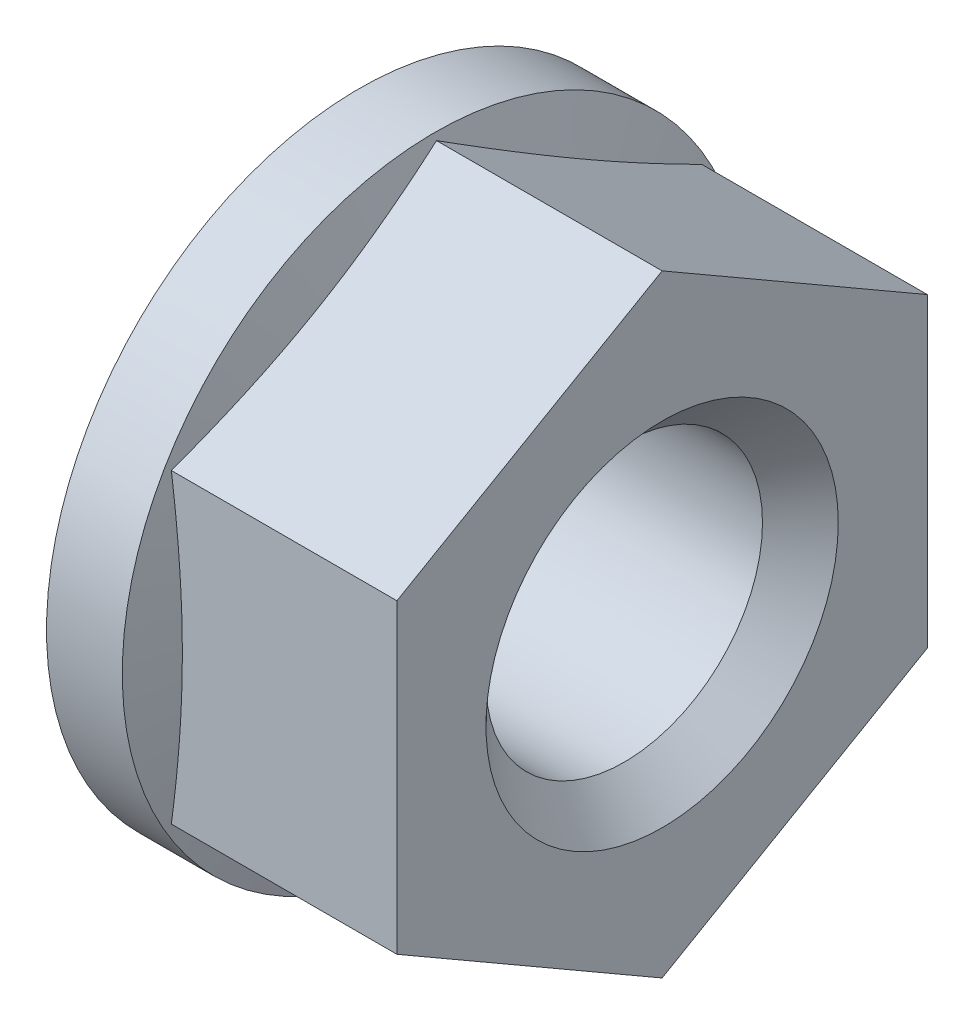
from build123d import *

# Parameters (mm, degrees)
BOSS_EXTRUDE1_REACH            = 16.147
F_7_3_7_3_DIAMETER_HOLE1_D     = 7.3
F_7_3_7_3_DIAMETER_HOLE1_DEPTH = 15
F_7_3_7_3_DIAMETER_HOLE1_TIP   = 2.193141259
CHAMFER1_SIZE                  = 1


with BuildPart() as part:
    # Sketch1 → Revolve1 (revolve)
    with BuildSketch(Plane.XY, mode=Mode.PRIVATE) as revolve1_sk:
        Polygon((0, 8.25), (0, 0), (4.210580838, 0), (2, 8.25), align=None)
    revolve(revolve1_sk.sketch.rotate(Axis((0, 0, 0), (1, 0, 0)), 270), axis=Axis((0, 0, 0), (1, 0, 0)))

    # Boss-Extrude1: up to this cone (the profile starts outside it)
    boss_extrude1_end = Plane(origin=(8, 0, 0), z_dir=(-1, 0, 0)).offset(3.789420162) * Cone(3.732e-06, 47.985144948, 12.857579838, align=(Align.CENTER, Align.CENTER, Align.MIN), mode=Mode.PRIVATE)
    # Sketch2 → Boss-Extrude1 (add, up to the surface)
    with BuildSketch(Plane(origin=(8, 0, 0), x_dir=(0, 0, -1), z_dir=(1, 0, 0)), mode=Mode.PRIVATE) as boss_extrude1_sk1:
        Polygon((-7, -4.041451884), (0, -8.082903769), (7, -4.041451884), (7, 4.041451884), (0, 8.082903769), (-7, 4.041451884), align=None)
    boss_extrude1_tool1 = extrude(boss_extrude1_sk1.sketch, amount=-BOSS_EXTRUDE1_REACH, mode=Mode.PRIVATE) - boss_extrude1_end
    add(boss_extrude1_tool1.solids().sort_by_distance((8, 0, 0))[0])

    # 7.3 _7.3_ Diameter Hole1
    with Locations(Plane(origin=(8, 0, 0), x_dir=(0, 0, -1), z_dir=(1, 0, 0))):
        with Locations((0, 0)):
            Hole(F_7_3_7_3_DIAMETER_HOLE1_D / 2, depth=F_7_3_7_3_DIAMETER_HOLE1_DEPTH)
            with Locations((0, 0, -(F_7_3_7_3_DIAMETER_HOLE1_DEPTH + F_7_3_7_3_DIAMETER_HOLE1_TIP / 2))):  # 118° drill point
                Cone(0, F_7_3_7_3_DIAMETER_HOLE1_D / 2, F_7_3_7_3_DIAMETER_HOLE1_TIP, mode=Mode.SUBTRACT)

    # Chamfer1
    chamfer1_edges = [part.edges().sort_by_distance(p)[0] for p in [
        (8, 0, -3.65),
    ]]
    chamfer(chamfer1_edges, length=CHAMFER1_SIZE)


solid = part.part
